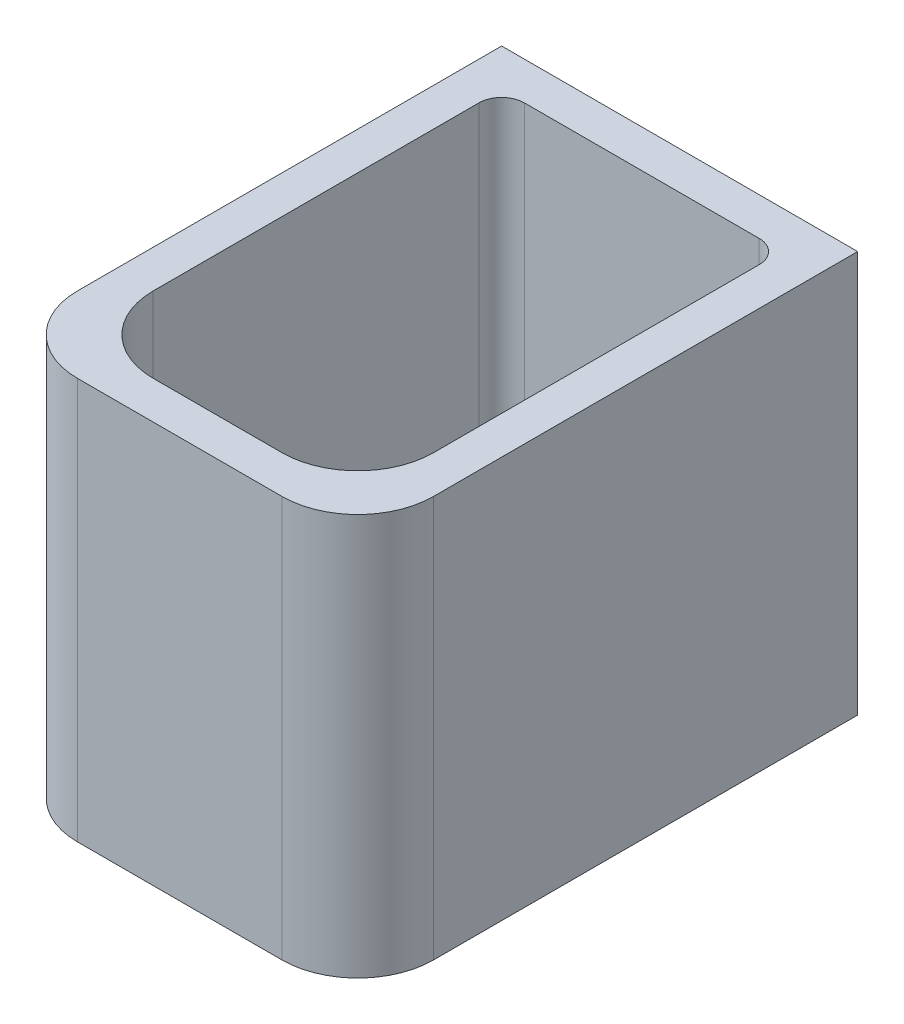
ISO-10303-21;
HEADER;
FILE_DESCRIPTION(('STEP AP214'),'2;1');
FILE_NAME('part.step','',(''),(''),'','','');
FILE_SCHEMA(('AUTOMOTIVE_DESIGN { 1 0 10303 214 1 1 1 1 }'));
ENDSEC;
DATA;
#1=APPLICATION_CONTEXT('core data for automotive mechanical design processes');
#2=APPLICATION_PROTOCOL_DEFINITION('international standard','automotive_design',2000,#1);
#3=PRODUCT_CONTEXT('',#1,'mechanical');
#4=PRODUCT('Part','Part','',(#3));
#5=PRODUCT_RELATED_PRODUCT_CATEGORY('part','',(#4));
#6=PRODUCT_DEFINITION_FORMATION('','',#4);
#7=PRODUCT_DEFINITION_CONTEXT('part definition',#1,'design');
#8=PRODUCT_DEFINITION('design','',#6,#7);
#9=PRODUCT_DEFINITION_SHAPE('','',#8);
#10=(LENGTH_UNIT() NAMED_UNIT(*) SI_UNIT(.MILLI.,.METRE.));
#11=(NAMED_UNIT(*) PLANE_ANGLE_UNIT() SI_UNIT($,.RADIAN.));
#12=(NAMED_UNIT(*) SI_UNIT($,.STERADIAN.) SOLID_ANGLE_UNIT());
#13=UNCERTAINTY_MEASURE_WITH_UNIT(LENGTH_MEASURE(1.E-05),#10,'distance_accuracy_value','');
#14=(GEOMETRIC_REPRESENTATION_CONTEXT(3) GLOBAL_UNCERTAINTY_ASSIGNED_CONTEXT((#13)) GLOBAL_UNIT_ASSIGNED_CONTEXT((#10,
#11,#12)) REPRESENTATION_CONTEXT('',''));
#15=CARTESIAN_POINT('',(0.,0.,0.));
#16=DIRECTION('',(0.,0.,1.));
#17=DIRECTION('',(1.,0.,0.));
#18=AXIS2_PLACEMENT_3D('',#15,#16,#17);
#19=CARTESIAN_POINT('',(2.35,0.3,3.3));
#20=DIRECTION('',(-1.,0.,0.));
#21=DIRECTION('',(0.,0.,1.));
#22=AXIS2_PLACEMENT_3D('',#19,#20,#21);
#23=PLANE('',#22);
#24=DIRECTION('',(0.,0.,-1.));
#25=VECTOR('',#24,1.);
#26=CARTESIAN_POINT('',(2.35,5.3,3.3));
#27=LINE('',#26,#25);
#28=CARTESIAN_POINT('',(2.35,5.3,2.3));
#29=VERTEX_POINT('',#28);
#30=CARTESIAN_POINT('',(2.35,5.3,-3.3));
#31=VERTEX_POINT('',#30);
#32=EDGE_CURVE('E136',#29,#31,#27,.T.);
#33=ORIENTED_EDGE('',*,*,#32,.F.);
#34=DIRECTION('',(0.,-1.,0.));
#35=VECTOR('',#34,1.);
#36=CARTESIAN_POINT('',(2.35,0.3,2.3));
#37=LINE('',#36,#35);
#38=CARTESIAN_POINT('',(2.35,0.,2.3));
#39=VERTEX_POINT('',#38);
#40=EDGE_CURVE('E206',#29,#39,#37,.T.);
#41=ORIENTED_EDGE('',*,*,#40,.T.);
#42=DIRECTION('',(0.,0.,-1.));
#43=VECTOR('',#42,1.);
#44=CARTESIAN_POINT('',(2.35,0.,3.3));
#45=LINE('',#44,#43);
#46=CARTESIAN_POINT('',(2.35,0.,-3.3));
#47=VERTEX_POINT('',#46);
#48=EDGE_CURVE('E154',#39,#47,#45,.T.);
#49=ORIENTED_EDGE('',*,*,#48,.T.);
#50=DIRECTION('',(0.,-1.,0.));
#51=VECTOR('',#50,1.);
#52=CARTESIAN_POINT('',(2.35,0.3,-3.3));
#53=LINE('',#52,#51);
#54=EDGE_CURVE('E152',#31,#47,#53,.T.);
#55=ORIENTED_EDGE('',*,*,#54,.F.);
#56=EDGE_LOOP('',(#33,#41,#49,#55));
#57=FACE_BOUND('',#56,.T.);
#58=ADVANCED_FACE('F34',(#57),#23,.F.);
#59=CARTESIAN_POINT('',(-2.35,0.3,-3.3));
#60=DIRECTION('',(0.,0.,1.));
#61=DIRECTION('',(1.,0.,0.));
#62=AXIS2_PLACEMENT_3D('',#59,#60,#61);
#63=PLANE('',#62);
#64=DIRECTION('',(-1.,0.,0.));
#65=VECTOR('',#64,1.);
#66=CARTESIAN_POINT('',(-2.35,0.,-3.3));
#67=LINE('',#66,#65);
#68=CARTESIAN_POINT('',(-2.35,0.,-3.3));
#69=VERTEX_POINT('',#68);
#70=EDGE_CURVE('E170',#47,#69,#67,.T.);
#71=ORIENTED_EDGE('',*,*,#70,.T.);
#72=DIRECTION('',(0.,-1.,0.));
#73=VECTOR('',#72,1.);
#74=CARTESIAN_POINT('',(-2.35,0.3,-3.3));
#75=LINE('',#74,#73);
#76=CARTESIAN_POINT('',(-2.35,5.3,-3.3));
#77=VERTEX_POINT('',#76);
#78=EDGE_CURVE('E158',#77,#69,#75,.T.);
#79=ORIENTED_EDGE('',*,*,#78,.F.);
#80=DIRECTION('',(-1.,0.,0.));
#81=VECTOR('',#80,1.);
#82=CARTESIAN_POINT('',(-2.35,5.3,-3.3));
#83=LINE('',#82,#81);
#84=EDGE_CURVE('E141',#31,#77,#83,.T.);
#85=ORIENTED_EDGE('',*,*,#84,.F.);
#86=ORIENTED_EDGE('',*,*,#54,.T.);
#87=EDGE_LOOP('',(#71,#79,#85,#86));
#88=FACE_BOUND('',#87,.T.);
#89=ADVANCED_FACE('F160',(#88),#63,.F.);
#90=CARTESIAN_POINT('',(-2.35,0.3,3.3));
#91=DIRECTION('',(1.,0.,0.));
#92=DIRECTION('',(0.,0.,-1.));
#93=AXIS2_PLACEMENT_3D('',#90,#91,#92);
#94=PLANE('',#93);
#95=DIRECTION('',(0.,0.,1.));
#96=VECTOR('',#95,1.);
#97=CARTESIAN_POINT('',(-2.35,0.,3.3));
#98=LINE('',#97,#96);
#99=CARTESIAN_POINT('',(-2.35,0.,2.3));
#100=VERTEX_POINT('',#99);
#101=EDGE_CURVE('E172',#69,#100,#98,.T.);
#102=ORIENTED_EDGE('',*,*,#101,.T.);
#103=DIRECTION('',(0.,-1.,0.));
#104=VECTOR('',#103,1.);
#105=CARTESIAN_POINT('',(-2.35,0.3,2.3));
#106=LINE('',#105,#104);
#107=CARTESIAN_POINT('',(-2.35,5.3,2.3));
#108=VERTEX_POINT('',#107);
#109=EDGE_CURVE('E187',#100,#108,#106,.F.);
#110=ORIENTED_EDGE('',*,*,#109,.T.);
#111=DIRECTION('',(0.,0.,1.));
#112=VECTOR('',#111,1.);
#113=CARTESIAN_POINT('',(-2.35,5.3,3.3));
#114=LINE('',#113,#112);
#115=EDGE_CURVE('E162',#77,#108,#114,.T.);
#116=ORIENTED_EDGE('',*,*,#115,.F.);
#117=ORIENTED_EDGE('',*,*,#78,.T.);
#118=EDGE_LOOP('',(#102,#110,#116,#117));
#119=FACE_BOUND('',#118,.T.);
#120=ADVANCED_FACE('F291',(#119),#94,.F.);
#121=CARTESIAN_POINT('',(-2.35,0.3,3.3));
#122=DIRECTION('',(0.,0.,-1.));
#123=DIRECTION('',(-1.,0.,0.));
#124=AXIS2_PLACEMENT_3D('',#121,#122,#123);
#125=PLANE('',#124);
#126=DIRECTION('',(1.,0.,0.));
#127=VECTOR('',#126,1.);
#128=CARTESIAN_POINT('',(-2.35,5.3,3.3));
#129=LINE('',#128,#127);
#130=CARTESIAN_POINT('',(-1.35,5.3,3.3));
#131=VERTEX_POINT('',#130);
#132=CARTESIAN_POINT('',(1.35,5.3,3.3));
#133=VERTEX_POINT('',#132);
#134=EDGE_CURVE('E164',#131,#133,#129,.T.);
#135=ORIENTED_EDGE('',*,*,#134,.F.);
#136=DIRECTION('',(0.,-1.,0.));
#137=VECTOR('',#136,1.);
#138=CARTESIAN_POINT('',(-1.35,0.3,3.3));
#139=LINE('',#138,#137);
#140=CARTESIAN_POINT('',(-1.35,0.,3.3));
#141=VERTEX_POINT('',#140);
#142=EDGE_CURVE('E180',#131,#141,#139,.T.);
#143=ORIENTED_EDGE('',*,*,#142,.T.);
#144=DIRECTION('',(1.,0.,0.));
#145=VECTOR('',#144,1.);
#146=CARTESIAN_POINT('',(-2.35,0.,3.3));
#147=LINE('',#146,#145);
#148=CARTESIAN_POINT('',(1.35,0.,3.3));
#149=VERTEX_POINT('',#148);
#150=EDGE_CURVE('E175',#141,#149,#147,.T.);
#151=ORIENTED_EDGE('',*,*,#150,.T.);
#152=DIRECTION('',(0.,-1.,0.));
#153=VECTOR('',#152,1.);
#154=CARTESIAN_POINT('',(1.35,0.3,3.3));
#155=LINE('',#154,#153);
#156=EDGE_CURVE('E157',#149,#133,#155,.F.);
#157=ORIENTED_EDGE('',*,*,#156,.T.);
#158=EDGE_LOOP('',(#135,#143,#151,#157));
#159=FACE_BOUND('',#158,.T.);
#160=ADVANCED_FACE('F296',(#159),#125,.F.);
#161=CARTESIAN_POINT('',(0.,0.,0.));
#162=DIRECTION('',(0.,-1.,0.));
#163=DIRECTION('',(0.,0.,-1.));
#164=AXIS2_PLACEMENT_3D('',#161,#162,#163);
#165=PLANE('',#164);
#166=ORIENTED_EDGE('',*,*,#150,.F.);
#167=CARTESIAN_POINT('',(-1.35,0.,2.3));
#168=DIRECTION('',(0.,-1.,0.));
#169=DIRECTION('',(0.,0.,-1.));
#170=AXIS2_PLACEMENT_3D('',#167,#168,#169);
#171=CIRCLE('',#170,1.);
#172=EDGE_CURVE('E185',#141,#100,#171,.T.);
#173=ORIENTED_EDGE('',*,*,#172,.T.);
#174=ORIENTED_EDGE('',*,*,#101,.F.);
#175=ORIENTED_EDGE('',*,*,#70,.F.);
#176=ORIENTED_EDGE('',*,*,#48,.F.);
#177=CARTESIAN_POINT('',(1.35,0.,2.3));
#178=DIRECTION('',(0.,-1.,0.));
#179=DIRECTION('',(0.,0.,-1.));
#180=AXIS2_PLACEMENT_3D('',#177,#178,#179);
#181=CIRCLE('',#180,1.);
#182=EDGE_CURVE('E183',#39,#149,#181,.T.);
#183=ORIENTED_EDGE('',*,*,#182,.T.);
#184=EDGE_LOOP('',(#166,#173,#174,#175,#176,#183));
#185=FACE_BOUND('',#184,.T.);
#186=ADVANCED_FACE('F300',(#185),#165,.T.);
#187=CARTESIAN_POINT('',(0.,5.3,0.));
#188=DIRECTION('',(0.,-1.,0.));
#189=DIRECTION('',(0.,0.,-1.));
#190=AXIS2_PLACEMENT_3D('',#187,#188,#189);
#191=PLANE('',#190);
#192=ORIENTED_EDGE('',*,*,#115,.T.);
#193=CARTESIAN_POINT('',(-1.35,5.3,2.3));
#194=DIRECTION('',(0.,-1.,0.));
#195=DIRECTION('',(0.,0.,-1.));
#196=AXIS2_PLACEMENT_3D('',#193,#194,#195);
#197=CIRCLE('',#196,1.);
#198=EDGE_CURVE('E190',#108,#131,#197,.F.);
#199=ORIENTED_EDGE('',*,*,#198,.T.);
#200=ORIENTED_EDGE('',*,*,#134,.T.);
#201=CARTESIAN_POINT('',(1.35,5.3,2.3));
#202=DIRECTION('',(0.,-1.,0.));
#203=DIRECTION('',(0.,0.,-1.));
#204=AXIS2_PLACEMENT_3D('',#201,#202,#203);
#205=CIRCLE('',#204,1.);
#206=EDGE_CURVE('E145',#133,#29,#205,.F.);
#207=ORIENTED_EDGE('',*,*,#206,.T.);
#208=ORIENTED_EDGE('',*,*,#32,.T.);
#209=ORIENTED_EDGE('',*,*,#84,.T.);
#210=EDGE_LOOP('',(#192,#199,#200,#207,#208,#209));
#211=FACE_BOUND('',#210,.T.);
#212=DIRECTION('',(0.,0.,-1.));
#213=VECTOR('',#212,1.);
#214=CARTESIAN_POINT('',(1.85,5.3,2.8));
#215=LINE('',#214,#213);
#216=CARTESIAN_POINT('',(1.85,5.3,1.8));
#217=VERTEX_POINT('',#216);
#218=CARTESIAN_POINT('',(1.85,5.3,-2.5));
#219=VERTEX_POINT('',#218);
#220=EDGE_CURVE('E236',#217,#219,#215,.T.);
#221=ORIENTED_EDGE('',*,*,#220,.F.);
#222=CARTESIAN_POINT('',(0.849999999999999,5.3,1.8));
#223=DIRECTION('',(0.,-1.,0.));
#224=DIRECTION('',(0.,0.,-1.));
#225=AXIS2_PLACEMENT_3D('',#222,#223,#224);
#226=CIRCLE('',#225,1.);
#227=CARTESIAN_POINT('',(0.849999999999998,5.3,2.8));
#228=VERTEX_POINT('',#227);
#229=EDGE_CURVE('E211',#217,#228,#226,.T.);
#230=ORIENTED_EDGE('',*,*,#229,.T.);
#231=DIRECTION('',(1.,0.,0.));
#232=VECTOR('',#231,1.);
#233=CARTESIAN_POINT('',(-1.85,5.3,2.8));
#234=LINE('',#233,#232);
#235=CARTESIAN_POINT('',(-0.849999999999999,5.3,2.8));
#236=VERTEX_POINT('',#235);
#237=EDGE_CURVE('E149',#236,#228,#234,.T.);
#238=ORIENTED_EDGE('',*,*,#237,.F.);
#239=CARTESIAN_POINT('',(-0.849999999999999,5.3,1.8));
#240=DIRECTION('',(0.,-1.,0.));
#241=DIRECTION('',(0.,0.,-1.));
#242=AXIS2_PLACEMENT_3D('',#239,#240,#241);
#243=CIRCLE('',#242,1.);
#244=CARTESIAN_POINT('',(-1.85,5.3,1.8));
#245=VERTEX_POINT('',#244);
#246=EDGE_CURVE('E208',#236,#245,#243,.T.);
#247=ORIENTED_EDGE('',*,*,#246,.T.);
#248=DIRECTION('',(0.,0.,1.));
#249=VECTOR('',#248,1.);
#250=CARTESIAN_POINT('',(-1.85,5.3,2.8));
#251=LINE('',#250,#249);
#252=CARTESIAN_POINT('',(-1.85,5.3,-2.5));
#253=VERTEX_POINT('',#252);
#254=EDGE_CURVE('E228',#253,#245,#251,.T.);
#255=ORIENTED_EDGE('',*,*,#254,.F.);
#256=CARTESIAN_POINT('',(-1.55,5.3,-2.5));
#257=DIRECTION('',(0.,-1.,0.));
#258=DIRECTION('',(0.,0.,-1.));
#259=AXIS2_PLACEMENT_3D('',#256,#257,#258);
#260=CIRCLE('',#259,0.3);
#261=CARTESIAN_POINT('',(-1.55,5.3,-2.8));
#262=VERTEX_POINT('',#261);
#263=EDGE_CURVE('E42',#253,#262,#260,.T.);
#264=ORIENTED_EDGE('',*,*,#263,.T.);
#265=DIRECTION('',(-1.,0.,0.));
#266=VECTOR('',#265,1.);
#267=CARTESIAN_POINT('',(-1.85,5.3,-2.8));
#268=LINE('',#267,#266);
#269=CARTESIAN_POINT('',(1.55,5.3,-2.8));
#270=VERTEX_POINT('',#269);
#271=EDGE_CURVE('E227',#270,#262,#268,.T.);
#272=ORIENTED_EDGE('',*,*,#271,.F.);
#273=CARTESIAN_POINT('',(1.55,5.3,-2.5));
#274=DIRECTION('',(0.,-1.,0.));
#275=DIRECTION('',(0.,0.,-1.));
#276=AXIS2_PLACEMENT_3D('',#273,#274,#275);
#277=CIRCLE('',#276,0.3);
#278=EDGE_CURVE('E11',#270,#219,#277,.T.);
#279=ORIENTED_EDGE('',*,*,#278,.T.);
#280=EDGE_LOOP('',(#221,#230,#238,#247,#255,#264,#272,#279));
#281=FACE_BOUND('',#280,.T.);
#282=ADVANCED_FACE('F139',(#211,#281),#191,.F.);
#283=CARTESIAN_POINT('',(1.85,5.3,2.8));
#284=DIRECTION('',(-1.,0.,0.));
#285=DIRECTION('',(0.,0.,1.));
#286=AXIS2_PLACEMENT_3D('',#283,#284,#285);
#287=PLANE('',#286);
#288=ORIENTED_EDGE('',*,*,#220,.T.);
#289=DIRECTION('',(0.,-1.,0.));
#290=VECTOR('',#289,1.);
#291=CARTESIAN_POINT('',(1.85,0.3,-2.5));
#292=LINE('',#291,#290);
#293=CARTESIAN_POINT('',(1.85,0.3,-2.5));
#294=VERTEX_POINT('',#293);
#295=EDGE_CURVE('E223',#219,#294,#292,.T.);
#296=ORIENTED_EDGE('',*,*,#295,.T.);
#297=DIRECTION('',(0.,0.,-1.));
#298=VECTOR('',#297,1.);
#299=CARTESIAN_POINT('',(1.85,0.3,2.8));
#300=LINE('',#299,#298);
#301=CARTESIAN_POINT('',(1.85,0.3,1.8));
#302=VERTEX_POINT('',#301);
#303=EDGE_CURVE('E249',#302,#294,#300,.T.);
#304=ORIENTED_EDGE('',*,*,#303,.F.);
#305=DIRECTION('',(0.,-1.,0.));
#306=VECTOR('',#305,1.);
#307=CARTESIAN_POINT('',(1.85,5.3,1.8));
#308=LINE('',#307,#306);
#309=EDGE_CURVE('E204',#302,#217,#308,.F.);
#310=ORIENTED_EDGE('',*,*,#309,.T.);
#311=EDGE_LOOP('',(#288,#296,#304,#310));
#312=FACE_BOUND('',#311,.T.);
#313=ADVANCED_FACE('F259',(#312),#287,.T.);
#314=CARTESIAN_POINT('',(-1.85,5.3,-2.8));
#315=DIRECTION('',(0.,0.,1.));
#316=DIRECTION('',(1.,0.,0.));
#317=AXIS2_PLACEMENT_3D('',#314,#315,#316);
#318=PLANE('',#317);
#319=ORIENTED_EDGE('',*,*,#271,.T.);
#320=DIRECTION('',(0.,-1.,0.));
#321=VECTOR('',#320,1.);
#322=CARTESIAN_POINT('',(-1.55,0.3,-2.8));
#323=LINE('',#322,#321);
#324=CARTESIAN_POINT('',(-1.55,0.3,-2.8));
#325=VERTEX_POINT('',#324);
#326=EDGE_CURVE('E215',#262,#325,#323,.T.);
#327=ORIENTED_EDGE('',*,*,#326,.T.);
#328=DIRECTION('',(-1.,0.,0.));
#329=VECTOR('',#328,1.);
#330=CARTESIAN_POINT('',(-1.85,0.3,-2.8));
#331=LINE('',#330,#329);
#332=CARTESIAN_POINT('',(1.55,0.3,-2.8));
#333=VERTEX_POINT('',#332);
#334=EDGE_CURVE('E243',#333,#325,#331,.T.);
#335=ORIENTED_EDGE('',*,*,#334,.F.);
#336=DIRECTION('',(0.,-1.,0.));
#337=VECTOR('',#336,1.);
#338=CARTESIAN_POINT('',(1.55,5.3,-2.8));
#339=LINE('',#338,#337);
#340=EDGE_CURVE('E213',#333,#270,#339,.F.);
#341=ORIENTED_EDGE('',*,*,#340,.T.);
#342=EDGE_LOOP('',(#319,#327,#335,#341));
#343=FACE_BOUND('',#342,.T.);
#344=ADVANCED_FACE('F232',(#343),#318,.T.);
#345=CARTESIAN_POINT('',(-1.85,5.3,2.8));
#346=DIRECTION('',(1.,0.,0.));
#347=DIRECTION('',(0.,0.,-1.));
#348=AXIS2_PLACEMENT_3D('',#345,#346,#347);
#349=PLANE('',#348);
#350=DIRECTION('',(0.,0.,1.));
#351=VECTOR('',#350,1.);
#352=CARTESIAN_POINT('',(-1.85,0.3,2.8));
#353=LINE('',#352,#351);
#354=CARTESIAN_POINT('',(-1.85,0.3,-2.5));
#355=VERTEX_POINT('',#354);
#356=CARTESIAN_POINT('',(-1.85,0.3,1.8));
#357=VERTEX_POINT('',#356);
#358=EDGE_CURVE('E241',#355,#357,#353,.T.);
#359=ORIENTED_EDGE('',*,*,#358,.F.);
#360=DIRECTION('',(0.,-1.,0.));
#361=VECTOR('',#360,1.);
#362=CARTESIAN_POINT('',(-1.85,5.3,-2.5));
#363=LINE('',#362,#361);
#364=EDGE_CURVE('E55',#355,#253,#363,.F.);
#365=ORIENTED_EDGE('',*,*,#364,.T.);
#366=ORIENTED_EDGE('',*,*,#254,.T.);
#367=DIRECTION('',(0.,-1.,0.));
#368=VECTOR('',#367,1.);
#369=CARTESIAN_POINT('',(-1.85,0.3,1.8));
#370=LINE('',#369,#368);
#371=EDGE_CURVE('E192',#245,#357,#370,.T.);
#372=ORIENTED_EDGE('',*,*,#371,.T.);
#373=EDGE_LOOP('',(#359,#365,#366,#372));
#374=FACE_BOUND('',#373,.T.);
#375=ADVANCED_FACE('F244',(#374),#349,.T.);
#376=CARTESIAN_POINT('',(-1.85,5.3,2.8));
#377=DIRECTION('',(0.,0.,-1.));
#378=DIRECTION('',(-1.,0.,0.));
#379=AXIS2_PLACEMENT_3D('',#376,#377,#378);
#380=PLANE('',#379);
#381=DIRECTION('',(1.,0.,0.));
#382=VECTOR('',#381,1.);
#383=CARTESIAN_POINT('',(-1.85,0.3,2.8));
#384=LINE('',#383,#382);
#385=CARTESIAN_POINT('',(-0.849999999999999,0.3,2.8));
#386=VERTEX_POINT('',#385);
#387=CARTESIAN_POINT('',(0.849999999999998,0.3,2.8));
#388=VERTEX_POINT('',#387);
#389=EDGE_CURVE('E246',#386,#388,#384,.T.);
#390=ORIENTED_EDGE('',*,*,#389,.F.);
#391=DIRECTION('',(0.,-1.,0.));
#392=VECTOR('',#391,1.);
#393=CARTESIAN_POINT('',(-0.849999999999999,5.3,2.8));
#394=LINE('',#393,#392);
#395=EDGE_CURVE('E202',#386,#236,#394,.F.);
#396=ORIENTED_EDGE('',*,*,#395,.T.);
#397=ORIENTED_EDGE('',*,*,#237,.T.);
#398=DIRECTION('',(0.,-1.,0.));
#399=VECTOR('',#398,1.);
#400=CARTESIAN_POINT('',(0.849999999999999,0.3,2.8));
#401=LINE('',#400,#399);
#402=EDGE_CURVE('E199',#228,#388,#401,.T.);
#403=ORIENTED_EDGE('',*,*,#402,.T.);
#404=EDGE_LOOP('',(#390,#396,#397,#403));
#405=FACE_BOUND('',#404,.T.);
#406=ADVANCED_FACE('F271',(#405),#380,.T.);
#407=CARTESIAN_POINT('',(0.,0.3,0.));
#408=DIRECTION('',(0.,-1.,0.));
#409=DIRECTION('',(0.,0.,-1.));
#410=AXIS2_PLACEMENT_3D('',#407,#408,#409);
#411=PLANE('',#410);
#412=ORIENTED_EDGE('',*,*,#334,.T.);
#413=CARTESIAN_POINT('',(-1.55,0.3,-2.5));
#414=DIRECTION('',(0.,-1.,0.));
#415=DIRECTION('',(0.,0.,-1.));
#416=AXIS2_PLACEMENT_3D('',#413,#414,#415);
#417=CIRCLE('',#416,0.3);
#418=EDGE_CURVE('E220',#325,#355,#417,.F.);
#419=ORIENTED_EDGE('',*,*,#418,.T.);
#420=ORIENTED_EDGE('',*,*,#358,.T.);
#421=CARTESIAN_POINT('',(-0.849999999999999,0.3,1.8));
#422=DIRECTION('',(0.,-1.,0.));
#423=DIRECTION('',(0.,0.,-1.));
#424=AXIS2_PLACEMENT_3D('',#421,#422,#423);
#425=CIRCLE('',#424,1.);
#426=EDGE_CURVE('E197',#357,#386,#425,.F.);
#427=ORIENTED_EDGE('',*,*,#426,.T.);
#428=ORIENTED_EDGE('',*,*,#389,.T.);
#429=CARTESIAN_POINT('',(0.849999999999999,0.3,1.8));
#430=DIRECTION('',(0.,-1.,0.));
#431=DIRECTION('',(0.,0.,-1.));
#432=AXIS2_PLACEMENT_3D('',#429,#430,#431);
#433=CIRCLE('',#432,1.);
#434=EDGE_CURVE('E195',#388,#302,#433,.F.);
#435=ORIENTED_EDGE('',*,*,#434,.T.);
#436=ORIENTED_EDGE('',*,*,#303,.T.);
#437=CARTESIAN_POINT('',(1.55,0.3,-2.5));
#438=DIRECTION('',(0.,-1.,0.));
#439=DIRECTION('',(0.,0.,-1.));
#440=AXIS2_PLACEMENT_3D('',#437,#438,#439);
#441=CIRCLE('',#440,0.3);
#442=EDGE_CURVE('E218',#294,#333,#441,.F.);
#443=ORIENTED_EDGE('',*,*,#442,.T.);
#444=EDGE_LOOP('',(#412,#419,#420,#427,#428,#435,#436,#443));
#445=FACE_BOUND('',#444,.T.);
#446=ADVANCED_FACE('F240',(#445),#411,.F.);
#447=CARTESIAN_POINT('',(-1.35,0.3,2.3));
#448=DIRECTION('',(0.,-1.,0.));
#449=DIRECTION('',(0.,0.,-1.));
#450=AXIS2_PLACEMENT_3D('',#447,#448,#449);
#451=CYLINDRICAL_SURFACE('',#450,1.);
#452=ORIENTED_EDGE('',*,*,#198,.F.);
#453=ORIENTED_EDGE('',*,*,#109,.F.);
#454=ORIENTED_EDGE('',*,*,#172,.F.);
#455=ORIENTED_EDGE('',*,*,#142,.F.);
#456=EDGE_LOOP('',(#452,#453,#454,#455));
#457=FACE_BOUND('',#456,.T.);
#458=ADVANCED_FACE('F276',(#457),#451,.T.);
#459=CARTESIAN_POINT('',(-0.849999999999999,5.3,1.8));
#460=DIRECTION('',(0.,1.,0.));
#461=DIRECTION('',(0.,0.,1.));
#462=AXIS2_PLACEMENT_3D('',#459,#460,#461);
#463=CYLINDRICAL_SURFACE('',#462,1.);
#464=ORIENTED_EDGE('',*,*,#246,.F.);
#465=ORIENTED_EDGE('',*,*,#395,.F.);
#466=ORIENTED_EDGE('',*,*,#426,.F.);
#467=ORIENTED_EDGE('',*,*,#371,.F.);
#468=EDGE_LOOP('',(#464,#465,#466,#467));
#469=FACE_BOUND('',#468,.T.);
#470=ADVANCED_FACE('F274',(#469),#463,.F.);
#471=CARTESIAN_POINT('',(0.849999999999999,5.3,1.8));
#472=DIRECTION('',(0.,1.,0.));
#473=DIRECTION('',(0.,0.,1.));
#474=AXIS2_PLACEMENT_3D('',#471,#472,#473);
#475=CYLINDRICAL_SURFACE('',#474,1.);
#476=ORIENTED_EDGE('',*,*,#229,.F.);
#477=ORIENTED_EDGE('',*,*,#309,.F.);
#478=ORIENTED_EDGE('',*,*,#434,.F.);
#479=ORIENTED_EDGE('',*,*,#402,.F.);
#480=EDGE_LOOP('',(#476,#477,#478,#479));
#481=FACE_BOUND('',#480,.T.);
#482=ADVANCED_FACE('F265',(#481),#475,.F.);
#483=CARTESIAN_POINT('',(1.35,0.3,2.3));
#484=DIRECTION('',(0.,-1.,0.));
#485=DIRECTION('',(0.,0.,-1.));
#486=AXIS2_PLACEMENT_3D('',#483,#484,#485);
#487=CYLINDRICAL_SURFACE('',#486,1.);
#488=ORIENTED_EDGE('',*,*,#206,.F.);
#489=ORIENTED_EDGE('',*,*,#156,.F.);
#490=ORIENTED_EDGE('',*,*,#182,.F.);
#491=ORIENTED_EDGE('',*,*,#40,.F.);
#492=EDGE_LOOP('',(#488,#489,#490,#491));
#493=FACE_BOUND('',#492,.T.);
#494=ADVANCED_FACE('F282',(#493),#487,.T.);
#495=CARTESIAN_POINT('',(-1.55,5.3,-2.5));
#496=DIRECTION('',(0.,1.,0.));
#497=DIRECTION('',(0.,0.,1.));
#498=AXIS2_PLACEMENT_3D('',#495,#496,#497);
#499=CYLINDRICAL_SURFACE('',#498,0.3);
#500=ORIENTED_EDGE('',*,*,#263,.F.);
#501=ORIENTED_EDGE('',*,*,#364,.F.);
#502=ORIENTED_EDGE('',*,*,#418,.F.);
#503=ORIENTED_EDGE('',*,*,#326,.F.);
#504=EDGE_LOOP('',(#500,#501,#502,#503));
#505=FACE_BOUND('',#504,.T.);
#506=ADVANCED_FACE('F238',(#505),#499,.F.);
#507=CARTESIAN_POINT('',(1.55,5.3,-2.5));
#508=DIRECTION('',(0.,1.,0.));
#509=DIRECTION('',(0.,0.,1.));
#510=AXIS2_PLACEMENT_3D('',#507,#508,#509);
#511=CYLINDRICAL_SURFACE('',#510,0.3);
#512=ORIENTED_EDGE('',*,*,#278,.F.);
#513=ORIENTED_EDGE('',*,*,#340,.F.);
#514=ORIENTED_EDGE('',*,*,#442,.F.);
#515=ORIENTED_EDGE('',*,*,#295,.F.);
#516=EDGE_LOOP('',(#512,#513,#514,#515));
#517=FACE_BOUND('',#516,.T.);
#518=ADVANCED_FACE('F36',(#517),#511,.F.);
#519=CLOSED_SHELL('',(#58,#89,#120,#160,#186,#282,#313,#344,#375,#406,#446,#458,#470,#482,#494,
#506,#518));
#520=MANIFOLD_SOLID_BREP('B2',#519);
#521=ADVANCED_BREP_SHAPE_REPRESENTATION('',(#18,#520),#14);
#522=SHAPE_DEFINITION_REPRESENTATION(#9,#521);
ENDSEC;
END-ISO-10303-21;
